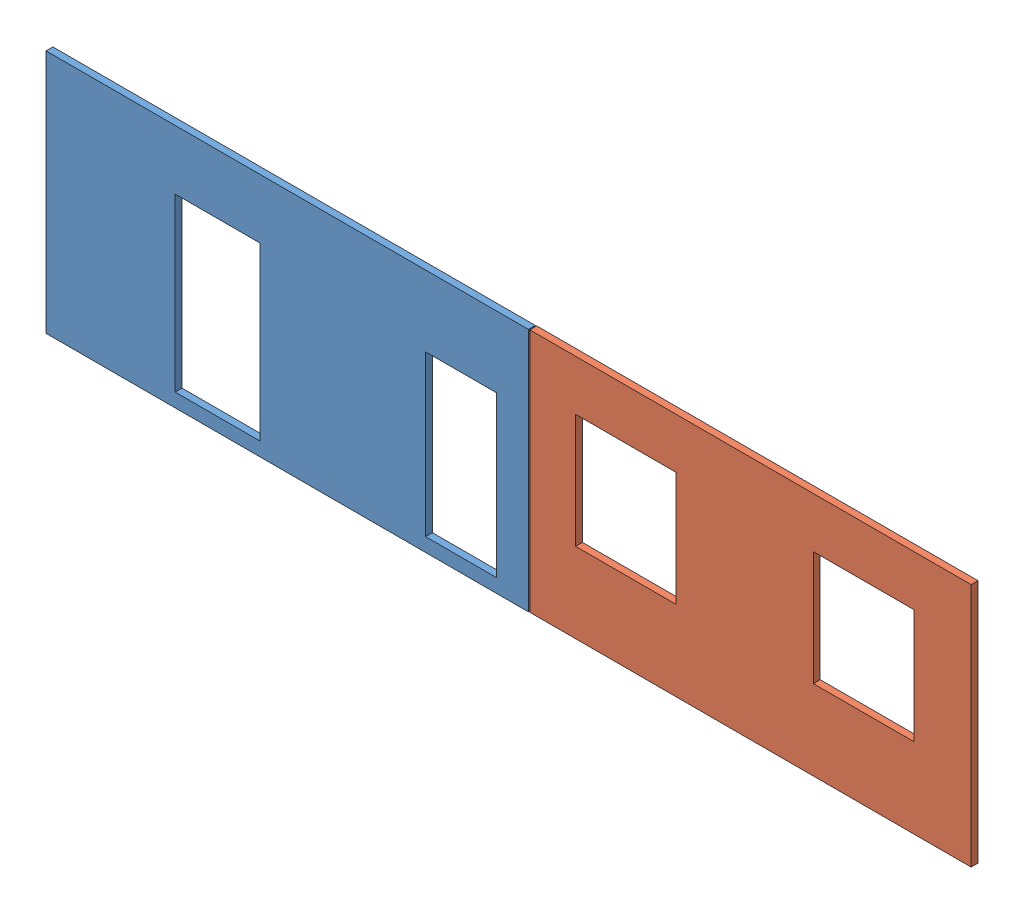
SolidWorks assembly Assemblage1.sldasm, configuration Défaut (file format 3400). Lengths in mm.
Overall size (404.62 107.13 3).
2 component instances, 2 part files, 0 mates.
Components (placement in the parent):
- doublage_AV-G-1: doublage_AV-G.SLDPRT [Défaut] at (-190.3343 -84.9678 0) size (211 107 3)
- doublage_AV-D-1: doublage_AV-D.SLDPRT [Défaut] at (21.2894 -84.8365 0) size (193 107 3)
